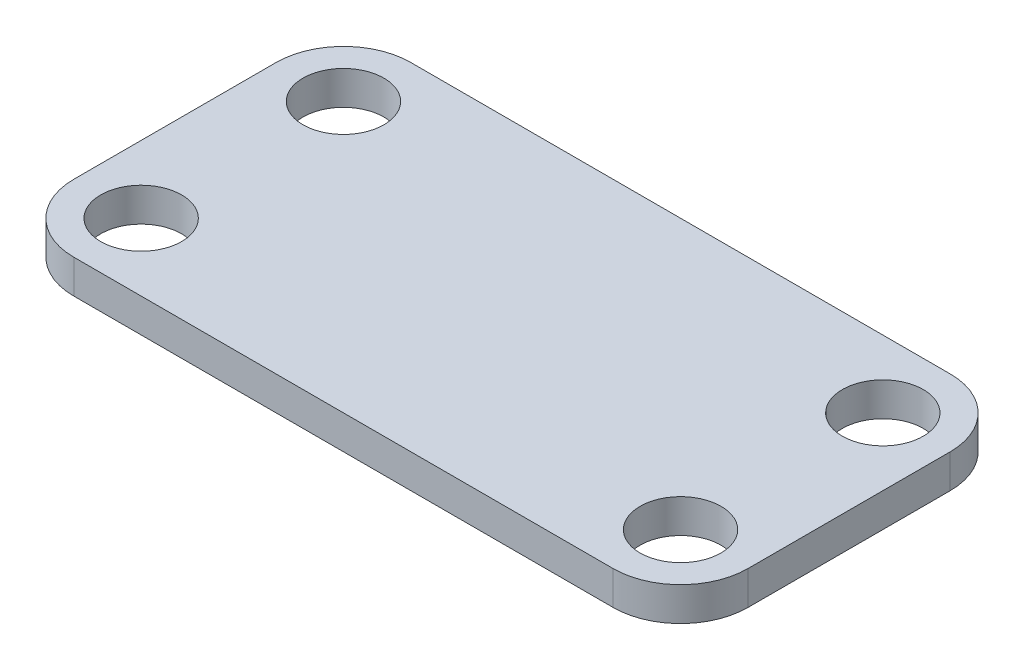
from build123d import *

# Parameters (mm, degrees)
SKETCH1_R      = 6
EXTRUDE1_DEPTH = 5


with BuildPart() as part:
    # Sketch1 → Extrude1 (new body)
    with BuildSketch(Plane(origin=(0, 0, 0), x_dir=(1, 0, 0), z_dir=(0, 1, 0))):
        with BuildLine():
            Line((-40, 25), (40, 25))
            ThreePointArc((40, 25), (47.071067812, 22.071067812), (50, 15))
            Line((50, 15), (50, -15))
            ThreePointArc((50, -15), (47.071067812, -22.071067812), (40, -25))
            Line((40, -25), (-40, -25))
            ThreePointArc((-40, -25), (-47.071067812, -22.071067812), (-50, -15))
            Line((-50, -15), (-50, 15))
            ThreePointArc((-50, 15), (-47.071067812, 22.071067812), (-40, 25))
        make_face()
        with Locations(Location((-40, 15, 0), (0, 0, 270))):
            Circle(SKETCH1_R, mode=Mode.SUBTRACT)
        with Locations(Location((-40, -15, 0), (0, 0, 270))):
            Circle(SKETCH1_R, mode=Mode.SUBTRACT)
        with Locations(Location((40, 15, 0), (0, 0, 270))):
            Circle(SKETCH1_R, mode=Mode.SUBTRACT)
        with Locations(Location((40, -15, 0), (0, 0, 270))):
            Circle(SKETCH1_R, mode=Mode.SUBTRACT)
    extrude(amount=EXTRUDE1_DEPTH)


solid = part.part
